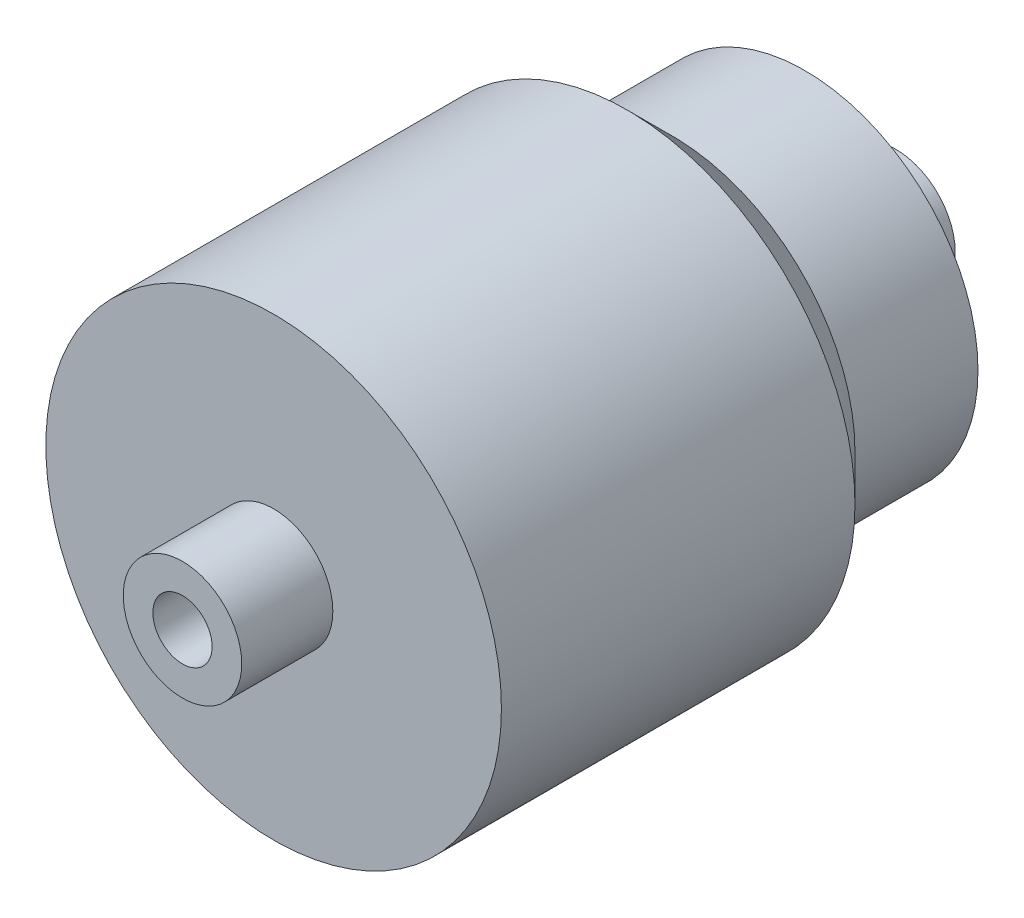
ISO-10303-21;
HEADER;
FILE_DESCRIPTION(('STEP AP214'),'2;1');
FILE_NAME('part.step','',(''),(''),'','','');
FILE_SCHEMA(('AUTOMOTIVE_DESIGN { 1 0 10303 214 1 1 1 1 }'));
ENDSEC;
DATA;
#1=APPLICATION_CONTEXT('core data for automotive mechanical design processes');
#2=APPLICATION_PROTOCOL_DEFINITION('international standard','automotive_design',2000,#1);
#3=PRODUCT_CONTEXT('',#1,'mechanical');
#4=PRODUCT('Part','Part','',(#3));
#5=PRODUCT_RELATED_PRODUCT_CATEGORY('part','',(#4));
#6=PRODUCT_DEFINITION_FORMATION('','',#4);
#7=PRODUCT_DEFINITION_CONTEXT('part definition',#1,'design');
#8=PRODUCT_DEFINITION('design','',#6,#7);
#9=PRODUCT_DEFINITION_SHAPE('','',#8);
#10=(LENGTH_UNIT() NAMED_UNIT(*) SI_UNIT(.MILLI.,.METRE.));
#11=(NAMED_UNIT(*) PLANE_ANGLE_UNIT() SI_UNIT($,.RADIAN.));
#12=(NAMED_UNIT(*) SI_UNIT($,.STERADIAN.) SOLID_ANGLE_UNIT());
#13=UNCERTAINTY_MEASURE_WITH_UNIT(LENGTH_MEASURE(1.E-05),#10,'distance_accuracy_value','');
#14=(GEOMETRIC_REPRESENTATION_CONTEXT(3) GLOBAL_UNCERTAINTY_ASSIGNED_CONTEXT((#13)) GLOBAL_UNIT_ASSIGNED_CONTEXT((#10,
#11,#12)) REPRESENTATION_CONTEXT('',''));
#15=CARTESIAN_POINT('',(0.,0.,0.));
#16=DIRECTION('',(0.,0.,1.));
#17=DIRECTION('',(1.,0.,0.));
#18=AXIS2_PLACEMENT_3D('',#15,#16,#17);
#19=CARTESIAN_POINT('',(0.,3.25,0.));
#20=DIRECTION('',(0.,0.,-1.));
#21=DIRECTION('',(-1.,0.,0.));
#22=AXIS2_PLACEMENT_3D('',#19,#20,#21);
#23=PLANE('',#22);
#24=CARTESIAN_POINT('',(0.,0.,0.));
#25=DIRECTION('',(0.,0.,1.));
#26=DIRECTION('',(1.,0.,0.));
#27=AXIS2_PLACEMENT_3D('',#24,#25,#26);
#28=CIRCLE('',#27,3.25);
#29=CARTESIAN_POINT('',(3.25,0.,0.));
#30=VERTEX_POINT('',#29);
#31=EDGE_CURVE('E66',#30,#30,#28,.T.);
#32=ORIENTED_EDGE('',*,*,#31,.F.);
#33=EDGE_LOOP('',(#32));
#34=FACE_BOUND('',#33,.T.);
#35=CARTESIAN_POINT('',(0.,0.,0.));
#36=DIRECTION('',(0.,0.,1.));
#37=DIRECTION('',(1.,0.,0.));
#38=AXIS2_PLACEMENT_3D('',#35,#36,#37);
#39=CIRCLE('',#38,6.5);
#40=CARTESIAN_POINT('',(6.5,0.,0.));
#41=VERTEX_POINT('',#40);
#42=EDGE_CURVE('E10',#41,#41,#39,.T.);
#43=ORIENTED_EDGE('',*,*,#42,.T.);
#44=EDGE_LOOP('',(#43));
#45=FACE_BOUND('',#44,.T.);
#46=ADVANCED_FACE('F29',(#34,#45),#23,.F.);
#47=CARTESIAN_POINT('',(0.,0.,0.));
#48=DIRECTION('',(0.,0.,1.));
#49=DIRECTION('',(1.,0.,0.));
#50=AXIS2_PLACEMENT_3D('',#47,#48,#49);
#51=CYLINDRICAL_SURFACE('',#50,6.5);
#52=ORIENTED_EDGE('',*,*,#42,.F.);
#53=EDGE_LOOP('',(#52));
#54=FACE_BOUND('',#53,.T.);
#55=CARTESIAN_POINT('',(0.,0.,-10.));
#56=DIRECTION('',(0.,0.,1.));
#57=DIRECTION('',(1.,0.,0.));
#58=AXIS2_PLACEMENT_3D('',#55,#56,#57);
#59=CIRCLE('',#58,6.5);
#60=CARTESIAN_POINT('',(6.5,0.,-10.));
#61=VERTEX_POINT('',#60);
#62=EDGE_CURVE('E35',#61,#61,#59,.T.);
#63=ORIENTED_EDGE('',*,*,#62,.T.);
#64=EDGE_LOOP('',(#63));
#65=FACE_BOUND('',#64,.T.);
#66=ADVANCED_FACE('F73',(#54,#65),#51,.T.);
#67=CARTESIAN_POINT('',(0.,6.5,-10.));
#68=DIRECTION('',(0.,0.,-1.));
#69=DIRECTION('',(-1.,0.,0.));
#70=AXIS2_PLACEMENT_3D('',#67,#68,#69);
#71=PLANE('',#70);
#72=ORIENTED_EDGE('',*,*,#62,.F.);
#73=EDGE_LOOP('',(#72));
#74=FACE_BOUND('',#73,.T.);
#75=CARTESIAN_POINT('',(0.,0.,-10.));
#76=DIRECTION('',(0.,0.,1.));
#77=DIRECTION('',(1.,0.,0.));
#78=AXIS2_PLACEMENT_3D('',#75,#76,#77);
#79=CIRCLE('',#78,25.);
#80=CARTESIAN_POINT('',(25.,0.,-10.));
#81=VERTEX_POINT('',#80);
#82=EDGE_CURVE('E39',#81,#81,#79,.T.);
#83=ORIENTED_EDGE('',*,*,#82,.T.);
#84=EDGE_LOOP('',(#83));
#85=FACE_BOUND('',#84,.T.);
#86=ADVANCED_FACE('F77',(#74,#85),#71,.F.);
#87=CARTESIAN_POINT('',(0.,0.,0.));
#88=DIRECTION('',(0.,0.,1.));
#89=DIRECTION('',(1.,0.,0.));
#90=AXIS2_PLACEMENT_3D('',#87,#88,#89);
#91=CYLINDRICAL_SURFACE('',#90,25.);
#92=ORIENTED_EDGE('',*,*,#82,.F.);
#93=EDGE_LOOP('',(#92));
#94=FACE_BOUND('',#93,.T.);
#95=CARTESIAN_POINT('',(0.,0.,-48.8));
#96=DIRECTION('',(0.,0.,1.));
#97=DIRECTION('',(1.,0.,0.));
#98=AXIS2_PLACEMENT_3D('',#95,#96,#97);
#99=CIRCLE('',#98,25.);
#100=CARTESIAN_POINT('',(25.,0.,-48.8));
#101=VERTEX_POINT('',#100);
#102=EDGE_CURVE('E43',#101,#101,#99,.T.);
#103=ORIENTED_EDGE('',*,*,#102,.T.);
#104=EDGE_LOOP('',(#103));
#105=FACE_BOUND('',#104,.T.);
#106=ADVANCED_FACE('F82',(#94,#105),#91,.T.);
#107=CARTESIAN_POINT('',(0.,0.,-53.8));
#108=DIRECTION('',(0.,0.,1.));
#109=DIRECTION('',(1.,0.,0.));
#110=AXIS2_PLACEMENT_3D('',#107,#108,#109);
#111=CONICAL_SURFACE('',#110,20.,0.785398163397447);
#112=ORIENTED_EDGE('',*,*,#102,.F.);
#113=EDGE_LOOP('',(#112));
#114=FACE_BOUND('',#113,.T.);
#115=CARTESIAN_POINT('',(0.,0.,-53.8));
#116=DIRECTION('',(0.,0.,1.));
#117=DIRECTION('',(1.,0.,0.));
#118=AXIS2_PLACEMENT_3D('',#115,#116,#117);
#119=CIRCLE('',#118,20.);
#120=CARTESIAN_POINT('',(20.,0.,-53.8));
#121=VERTEX_POINT('',#120);
#122=EDGE_CURVE('E48',#121,#121,#119,.T.);
#123=ORIENTED_EDGE('',*,*,#122,.T.);
#124=EDGE_LOOP('',(#123));
#125=FACE_BOUND('',#124,.T.);
#126=ADVANCED_FACE('F88',(#114,#125),#111,.T.);
#127=CARTESIAN_POINT('',(0.,20.,-53.8));
#128=DIRECTION('',(0.,0.,1.));
#129=DIRECTION('',(1.,0.,0.));
#130=AXIS2_PLACEMENT_3D('',#127,#128,#129);
#131=PLANE('',#130);
#132=ORIENTED_EDGE('',*,*,#122,.F.);
#133=EDGE_LOOP('',(#132));
#134=FACE_BOUND('',#133,.T.);
#135=CARTESIAN_POINT('',(0.,0.,-53.8));
#136=DIRECTION('',(0.,0.,1.));
#137=DIRECTION('',(1.,0.,0.));
#138=AXIS2_PLACEMENT_3D('',#135,#136,#137);
#139=CIRCLE('',#138,19.);
#140=CARTESIAN_POINT('',(19.,0.,-53.8));
#141=VERTEX_POINT('',#140);
#142=EDGE_CURVE('E51',#141,#141,#139,.T.);
#143=ORIENTED_EDGE('',*,*,#142,.T.);
#144=EDGE_LOOP('',(#143));
#145=FACE_BOUND('',#144,.T.);
#146=ADVANCED_FACE('F92',(#134,#145),#131,.F.);
#147=CARTESIAN_POINT('',(0.,0.,0.));
#148=DIRECTION('',(0.,0.,1.));
#149=DIRECTION('',(1.,0.,0.));
#150=AXIS2_PLACEMENT_3D('',#147,#148,#149);
#151=CYLINDRICAL_SURFACE('',#150,19.);
#152=ORIENTED_EDGE('',*,*,#142,.F.);
#153=EDGE_LOOP('',(#152));
#154=FACE_BOUND('',#153,.T.);
#155=CARTESIAN_POINT('',(0.,0.,-68.3));
#156=DIRECTION('',(0.,0.,1.));
#157=DIRECTION('',(1.,0.,0.));
#158=AXIS2_PLACEMENT_3D('',#155,#156,#157);
#159=CIRCLE('',#158,19.);
#160=CARTESIAN_POINT('',(19.,0.,-68.3));
#161=VERTEX_POINT('',#160);
#162=EDGE_CURVE('E54',#161,#161,#159,.T.);
#163=ORIENTED_EDGE('',*,*,#162,.T.);
#164=EDGE_LOOP('',(#163));
#165=FACE_BOUND('',#164,.T.);
#166=ADVANCED_FACE('F96',(#154,#165),#151,.T.);
#167=CARTESIAN_POINT('',(0.,19.,-68.3));
#168=DIRECTION('',(0.,0.,1.));
#169=DIRECTION('',(1.,0.,0.));
#170=AXIS2_PLACEMENT_3D('',#167,#168,#169);
#171=PLANE('',#170);
#172=ORIENTED_EDGE('',*,*,#162,.F.);
#173=EDGE_LOOP('',(#172));
#174=FACE_BOUND('',#173,.T.);
#175=CARTESIAN_POINT('',(0.,0.,-68.3));
#176=DIRECTION('',(0.,0.,1.));
#177=DIRECTION('',(1.,0.,0.));
#178=AXIS2_PLACEMENT_3D('',#175,#176,#177);
#179=CIRCLE('',#178,6.5);
#180=CARTESIAN_POINT('',(6.5,0.,-68.3));
#181=VERTEX_POINT('',#180);
#182=EDGE_CURVE('E57',#181,#181,#179,.T.);
#183=ORIENTED_EDGE('',*,*,#182,.T.);
#184=EDGE_LOOP('',(#183));
#185=FACE_BOUND('',#184,.T.);
#186=ADVANCED_FACE('F100',(#174,#185),#171,.F.);
#187=CARTESIAN_POINT('',(0.,0.,0.));
#188=DIRECTION('',(0.,0.,1.));
#189=DIRECTION('',(1.,0.,0.));
#190=AXIS2_PLACEMENT_3D('',#187,#188,#189);
#191=CYLINDRICAL_SURFACE('',#190,6.5);
#192=ORIENTED_EDGE('',*,*,#182,.F.);
#193=EDGE_LOOP('',(#192));
#194=FACE_BOUND('',#193,.T.);
#195=CARTESIAN_POINT('',(0.,0.,-78.3));
#196=DIRECTION('',(0.,0.,1.));
#197=DIRECTION('',(1.,0.,0.));
#198=AXIS2_PLACEMENT_3D('',#195,#196,#197);
#199=CIRCLE('',#198,6.5);
#200=CARTESIAN_POINT('',(6.5,0.,-78.3));
#201=VERTEX_POINT('',#200);
#202=EDGE_CURVE('E60',#201,#201,#199,.T.);
#203=ORIENTED_EDGE('',*,*,#202,.T.);
#204=EDGE_LOOP('',(#203));
#205=FACE_BOUND('',#204,.T.);
#206=ADVANCED_FACE('F104',(#194,#205),#191,.T.);
#207=CARTESIAN_POINT('',(0.,6.5,-78.3));
#208=DIRECTION('',(0.,0.,1.));
#209=DIRECTION('',(1.,0.,0.));
#210=AXIS2_PLACEMENT_3D('',#207,#208,#209);
#211=PLANE('',#210);
#212=ORIENTED_EDGE('',*,*,#202,.F.);
#213=EDGE_LOOP('',(#212));
#214=FACE_BOUND('',#213,.T.);
#215=CARTESIAN_POINT('',(0.,0.,-78.3));
#216=DIRECTION('',(0.,0.,1.));
#217=DIRECTION('',(1.,0.,0.));
#218=AXIS2_PLACEMENT_3D('',#215,#216,#217);
#219=CIRCLE('',#218,3.25);
#220=CARTESIAN_POINT('',(3.25,0.,-78.3));
#221=VERTEX_POINT('',#220);
#222=EDGE_CURVE('E63',#221,#221,#219,.T.);
#223=ORIENTED_EDGE('',*,*,#222,.T.);
#224=EDGE_LOOP('',(#223));
#225=FACE_BOUND('',#224,.T.);
#226=ADVANCED_FACE('F108',(#214,#225),#211,.F.);
#227=CARTESIAN_POINT('',(0.,0.,0.));
#228=DIRECTION('',(0.,0.,1.));
#229=DIRECTION('',(1.,0.,0.));
#230=AXIS2_PLACEMENT_3D('',#227,#228,#229);
#231=CYLINDRICAL_SURFACE('',#230,3.25);
#232=ORIENTED_EDGE('',*,*,#222,.F.);
#233=EDGE_LOOP('',(#232));
#234=FACE_BOUND('',#233,.T.);
#235=ORIENTED_EDGE('',*,*,#31,.T.);
#236=EDGE_LOOP('',(#235));
#237=FACE_BOUND('',#236,.T.);
#238=ADVANCED_FACE('F70',(#234,#237),#231,.F.);
#239=CLOSED_SHELL('',(#46,#66,#86,#106,#126,#146,#166,#186,#206,#226,#238));
#240=MANIFOLD_SOLID_BREP('B2',#239);
#241=ADVANCED_BREP_SHAPE_REPRESENTATION('',(#18,#240),#14);
#242=SHAPE_DEFINITION_REPRESENTATION(#9,#241);
ENDSEC;
END-ISO-10303-21;
